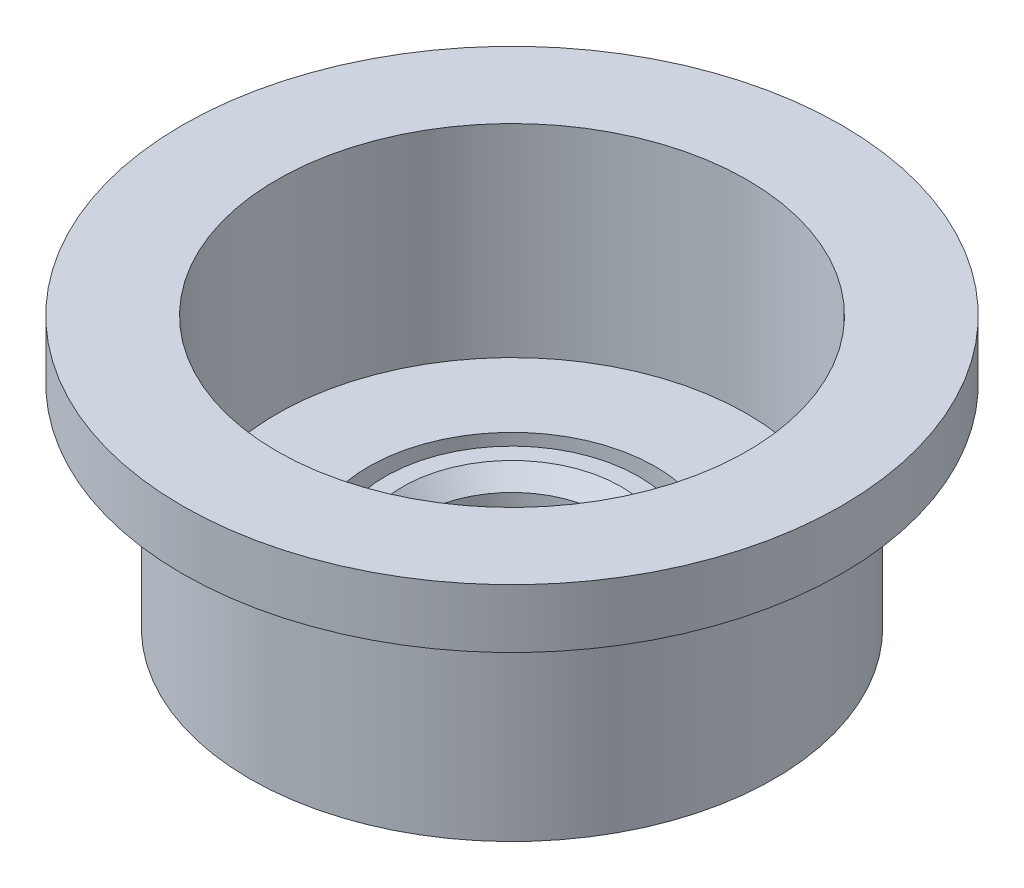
ISO-10303-21;
HEADER;
FILE_DESCRIPTION(('STEP AP214'),'2;1');
FILE_NAME('part.step','',(''),(''),'','','');
FILE_SCHEMA(('AUTOMOTIVE_DESIGN { 1 0 10303 214 1 1 1 1 }'));
ENDSEC;
DATA;
#1=APPLICATION_CONTEXT('core data for automotive mechanical design processes');
#2=APPLICATION_PROTOCOL_DEFINITION('international standard','automotive_design',2000,#1);
#3=PRODUCT_CONTEXT('',#1,'mechanical');
#4=PRODUCT('Part','Part','',(#3));
#5=PRODUCT_RELATED_PRODUCT_CATEGORY('part','',(#4));
#6=PRODUCT_DEFINITION_FORMATION('','',#4);
#7=PRODUCT_DEFINITION_CONTEXT('part definition',#1,'design');
#8=PRODUCT_DEFINITION('design','',#6,#7);
#9=PRODUCT_DEFINITION_SHAPE('','',#8);
#10=(LENGTH_UNIT() NAMED_UNIT(*) SI_UNIT(.MILLI.,.METRE.));
#11=(NAMED_UNIT(*) PLANE_ANGLE_UNIT() SI_UNIT($,.RADIAN.));
#12=(NAMED_UNIT(*) SI_UNIT($,.STERADIAN.) SOLID_ANGLE_UNIT());
#13=UNCERTAINTY_MEASURE_WITH_UNIT(LENGTH_MEASURE(1.E-05),#10,'distance_accuracy_value','');
#14=(GEOMETRIC_REPRESENTATION_CONTEXT(3) GLOBAL_UNCERTAINTY_ASSIGNED_CONTEXT((#13)) GLOBAL_UNIT_ASSIGNED_CONTEXT((#10,
#11,#12)) REPRESENTATION_CONTEXT('',''));
#15=CARTESIAN_POINT('',(0.,0.,0.));
#16=DIRECTION('',(0.,0.,1.));
#17=DIRECTION('',(1.,0.,0.));
#18=AXIS2_PLACEMENT_3D('',#15,#16,#17);
#19=CARTESIAN_POINT('',(0.,6.34999999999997,11.90625));
#20=DIRECTION('',(0.,-1.,0.));
#21=DIRECTION('',(0.,0.,-1.));
#22=AXIS2_PLACEMENT_3D('',#19,#20,#21);
#23=PLANE('',#22);
#24=CARTESIAN_POINT('',(0.,6.34999999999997,0.));
#25=DIRECTION('',(0.,-1.,0.));
#26=DIRECTION('',(0.,0.,-1.));
#27=AXIS2_PLACEMENT_3D('',#24,#25,#26);
#28=CIRCLE('',#27,10.25525);
#29=CARTESIAN_POINT('',(0.,6.34999999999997,-10.25525));
#30=VERTEX_POINT('',#29);
#31=EDGE_CURVE('E43',#30,#30,#28,.T.);
#32=ORIENTED_EDGE('',*,*,#31,.T.);
#33=EDGE_LOOP('',(#32));
#34=FACE_BOUND('',#33,.T.);
#35=CARTESIAN_POINT('',(0.,6.34999999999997,0.));
#36=DIRECTION('',(0.,-1.,0.));
#37=DIRECTION('',(0.,0.,-1.));
#38=AXIS2_PLACEMENT_3D('',#35,#36,#37);
#39=CIRCLE('',#38,11.90625);
#40=CARTESIAN_POINT('',(0.,6.34999999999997,-11.90625));
#41=VERTEX_POINT('',#40);
#42=EDGE_CURVE('E47',#41,#41,#39,.T.);
#43=ORIENTED_EDGE('',*,*,#42,.F.);
#44=EDGE_LOOP('',(#43));
#45=FACE_BOUND('',#44,.T.);
#46=ADVANCED_FACE('F36',(#34,#45),#23,.F.);
#47=CARTESIAN_POINT('',(0.,0.,0.));
#48=DIRECTION('',(0.,-1.,0.));
#49=DIRECTION('',(0.,0.,-1.));
#50=AXIS2_PLACEMENT_3D('',#47,#48,#49);
#51=CYLINDRICAL_SURFACE('',#50,11.90625);
#52=CARTESIAN_POINT('',(0.,2.53999999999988,0.));
#53=DIRECTION('',(0.,-1.,0.));
#54=DIRECTION('',(0.,0.,-1.));
#55=AXIS2_PLACEMENT_3D('',#52,#53,#54);
#56=CIRCLE('',#55,11.90625);
#57=CARTESIAN_POINT('',(0.,2.53999999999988,-11.90625));
#58=VERTEX_POINT('',#57);
#59=EDGE_CURVE('E51',#58,#58,#56,.T.);
#60=ORIENTED_EDGE('',*,*,#59,.F.);
#61=EDGE_LOOP('',(#60));
#62=FACE_BOUND('',#61,.T.);
#63=ORIENTED_EDGE('',*,*,#42,.T.);
#64=EDGE_LOOP('',(#63));
#65=FACE_BOUND('',#64,.T.);
#66=ADVANCED_FACE('F137',(#62,#65),#51,.T.);
#67=CARTESIAN_POINT('',(1.11022302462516E-13,2.53999999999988,13.4937500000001));
#68=DIRECTION('',(0.,-1.,0.));
#69=DIRECTION('',(0.,0.,-1.));
#70=AXIS2_PLACEMENT_3D('',#67,#68,#69);
#71=PLANE('',#70);
#72=CARTESIAN_POINT('',(0.,2.53999999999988,0.));
#73=DIRECTION('',(0.,-1.,0.));
#74=DIRECTION('',(0.,0.,-1.));
#75=AXIS2_PLACEMENT_3D('',#72,#73,#74);
#76=CIRCLE('',#75,13.49375);
#77=CARTESIAN_POINT('',(0.,2.53999999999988,-13.49375));
#78=VERTEX_POINT('',#77);
#79=EDGE_CURVE('E56',#78,#78,#76,.T.);
#80=ORIENTED_EDGE('',*,*,#79,.F.);
#81=EDGE_LOOP('',(#80));
#82=FACE_BOUND('',#81,.T.);
#83=ORIENTED_EDGE('',*,*,#59,.T.);
#84=EDGE_LOOP('',(#83));
#85=FACE_BOUND('',#84,.T.);
#86=ADVANCED_FACE('F131',(#82,#85),#71,.F.);
#87=CARTESIAN_POINT('',(0.,0.,0.));
#88=DIRECTION('',(0.,-1.,0.));
#89=DIRECTION('',(0.,0.,-1.));
#90=AXIS2_PLACEMENT_3D('',#87,#88,#89);
#91=CYLINDRICAL_SURFACE('',#90,13.49375);
#92=CARTESIAN_POINT('',(0.,6.34999999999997,0.));
#93=DIRECTION('',(0.,-1.,0.));
#94=DIRECTION('',(0.,0.,-1.));
#95=AXIS2_PLACEMENT_3D('',#92,#93,#94);
#96=CIRCLE('',#95,13.49375);
#97=CARTESIAN_POINT('',(0.,6.34999999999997,-13.49375));
#98=VERTEX_POINT('',#97);
#99=EDGE_CURVE('E59',#98,#98,#96,.T.);
#100=ORIENTED_EDGE('',*,*,#99,.F.);
#101=EDGE_LOOP('',(#100));
#102=FACE_BOUND('',#101,.T.);
#103=ORIENTED_EDGE('',*,*,#79,.T.);
#104=EDGE_LOOP('',(#103));
#105=FACE_BOUND('',#104,.T.);
#106=ADVANCED_FACE('F125',(#102,#105),#91,.F.);
#107=CARTESIAN_POINT('',(0.,6.34999999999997,22.0979999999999));
#108=DIRECTION('',(0.,-1.,0.));
#109=DIRECTION('',(0.,0.,-1.));
#110=AXIS2_PLACEMENT_3D('',#107,#108,#109);
#111=PLANE('',#110);
#112=CARTESIAN_POINT('',(0.,6.34999999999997,0.));
#113=DIRECTION('',(0.,-1.,0.));
#114=DIRECTION('',(0.,0.,-1.));
#115=AXIS2_PLACEMENT_3D('',#112,#113,#114);
#116=CIRCLE('',#115,22.098);
#117=CARTESIAN_POINT('',(0.,6.34999999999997,-22.098));
#118=VERTEX_POINT('',#117);
#119=EDGE_CURVE('E62',#118,#118,#116,.T.);
#120=ORIENTED_EDGE('',*,*,#119,.F.);
#121=EDGE_LOOP('',(#120));
#122=FACE_BOUND('',#121,.T.);
#123=ORIENTED_EDGE('',*,*,#99,.T.);
#124=EDGE_LOOP('',(#123));
#125=FACE_BOUND('',#124,.T.);
#126=ADVANCED_FACE('F119',(#122,#125),#111,.F.);
#127=CARTESIAN_POINT('',(0.,0.,0.));
#128=DIRECTION('',(0.,-1.,0.));
#129=DIRECTION('',(0.,0.,-1.));
#130=AXIS2_PLACEMENT_3D('',#127,#128,#129);
#131=CYLINDRICAL_SURFACE('',#130,22.098);
#132=CARTESIAN_POINT('',(0.,25.3999999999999,0.));
#133=DIRECTION('',(0.,-1.,0.));
#134=DIRECTION('',(0.,0.,-1.));
#135=AXIS2_PLACEMENT_3D('',#132,#133,#134);
#136=CIRCLE('',#135,22.098);
#137=CARTESIAN_POINT('',(0.,25.3999999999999,-22.098));
#138=VERTEX_POINT('',#137);
#139=EDGE_CURVE('E65',#138,#138,#136,.T.);
#140=ORIENTED_EDGE('',*,*,#139,.F.);
#141=EDGE_LOOP('',(#140));
#142=FACE_BOUND('',#141,.T.);
#143=ORIENTED_EDGE('',*,*,#119,.T.);
#144=EDGE_LOOP('',(#143));
#145=FACE_BOUND('',#144,.T.);
#146=ADVANCED_FACE('F113',(#142,#145),#131,.F.);
#147=CARTESIAN_POINT('',(0.,25.3999999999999,30.988));
#148=DIRECTION('',(0.,-1.,0.));
#149=DIRECTION('',(0.,0.,-1.));
#150=AXIS2_PLACEMENT_3D('',#147,#148,#149);
#151=PLANE('',#150);
#152=CARTESIAN_POINT('',(0.,25.3999999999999,0.));
#153=DIRECTION('',(0.,-1.,0.));
#154=DIRECTION('',(0.,0.,-1.));
#155=AXIS2_PLACEMENT_3D('',#152,#153,#154);
#156=CIRCLE('',#155,30.988);
#157=CARTESIAN_POINT('',(0.,25.3999999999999,-30.988));
#158=VERTEX_POINT('',#157);
#159=EDGE_CURVE('E68',#158,#158,#156,.T.);
#160=ORIENTED_EDGE('',*,*,#159,.F.);
#161=EDGE_LOOP('',(#160));
#162=FACE_BOUND('',#161,.T.);
#163=ORIENTED_EDGE('',*,*,#139,.T.);
#164=EDGE_LOOP('',(#163));
#165=FACE_BOUND('',#164,.T.);
#166=ADVANCED_FACE('F107',(#162,#165),#151,.F.);
#167=CARTESIAN_POINT('',(0.,0.,0.));
#168=DIRECTION('',(0.,-1.,0.));
#169=DIRECTION('',(0.,0.,-1.));
#170=AXIS2_PLACEMENT_3D('',#167,#168,#169);
#171=CYLINDRICAL_SURFACE('',#170,30.988);
#172=CARTESIAN_POINT('',(0.,19.8752784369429,0.));
#173=DIRECTION('',(0.,-1.,0.));
#174=DIRECTION('',(0.,0.,-1.));
#175=AXIS2_PLACEMENT_3D('',#172,#173,#174);
#176=CIRCLE('',#175,30.988);
#177=CARTESIAN_POINT('',(0.,19.8752784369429,-30.988));
#178=VERTEX_POINT('',#177);
#179=EDGE_CURVE('E71',#178,#178,#176,.T.);
#180=ORIENTED_EDGE('',*,*,#179,.F.);
#181=EDGE_LOOP('',(#180));
#182=FACE_BOUND('',#181,.T.);
#183=ORIENTED_EDGE('',*,*,#159,.T.);
#184=EDGE_LOOP('',(#183));
#185=FACE_BOUND('',#184,.T.);
#186=ADVANCED_FACE('F101',(#182,#185),#171,.T.);
#187=CARTESIAN_POINT('',(0.,19.8752784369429,24.6379999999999));
#188=DIRECTION('',(0.,1.,0.));
#189=DIRECTION('',(0.,0.,1.));
#190=AXIS2_PLACEMENT_3D('',#187,#188,#189);
#191=PLANE('',#190);
#192=CARTESIAN_POINT('',(0.,19.8752784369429,0.));
#193=DIRECTION('',(0.,-1.,0.));
#194=DIRECTION('',(0.,0.,-1.));
#195=AXIS2_PLACEMENT_3D('',#192,#193,#194);
#196=CIRCLE('',#195,24.638);
#197=CARTESIAN_POINT('',(0.,19.8752784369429,-24.638));
#198=VERTEX_POINT('',#197);
#199=EDGE_CURVE('E74',#198,#198,#196,.T.);
#200=ORIENTED_EDGE('',*,*,#199,.F.);
#201=EDGE_LOOP('',(#200));
#202=FACE_BOUND('',#201,.T.);
#203=ORIENTED_EDGE('',*,*,#179,.T.);
#204=EDGE_LOOP('',(#203));
#205=FACE_BOUND('',#204,.T.);
#206=ADVANCED_FACE('F95',(#202,#205),#191,.F.);
#207=CARTESIAN_POINT('',(0.,0.,0.));
#208=DIRECTION('',(0.,-1.,0.));
#209=DIRECTION('',(0.,0.,-1.));
#210=AXIS2_PLACEMENT_3D('',#207,#208,#209);
#211=CYLINDRICAL_SURFACE('',#210,24.638);
#212=CARTESIAN_POINT('',(0.,0.,0.));
#213=DIRECTION('',(0.,-1.,0.));
#214=DIRECTION('',(0.,0.,-1.));
#215=AXIS2_PLACEMENT_3D('',#212,#213,#214);
#216=CIRCLE('',#215,24.638);
#217=CARTESIAN_POINT('',(0.,0.,-24.638));
#218=VERTEX_POINT('',#217);
#219=EDGE_CURVE('E77',#218,#218,#216,.T.);
#220=ORIENTED_EDGE('',*,*,#219,.F.);
#221=EDGE_LOOP('',(#220));
#222=FACE_BOUND('',#221,.T.);
#223=ORIENTED_EDGE('',*,*,#199,.T.);
#224=EDGE_LOOP('',(#223));
#225=FACE_BOUND('',#224,.T.);
#226=ADVANCED_FACE('F89',(#222,#225),#211,.T.);
#227=CARTESIAN_POINT('',(0.,-1.11022302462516E-13,24.6379999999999));
#228=DIRECTION('',(0.,1.,0.));
#229=DIRECTION('',(0.,0.,1.));
#230=AXIS2_PLACEMENT_3D('',#227,#228,#229);
#231=PLANE('',#230);
#232=CARTESIAN_POINT('',(0.,0.,0.));
#233=DIRECTION('',(0.,-1.,0.));
#234=DIRECTION('',(0.,0.,-1.));
#235=AXIS2_PLACEMENT_3D('',#232,#233,#234);
#236=CIRCLE('',#235,8.73124999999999);
#237=CARTESIAN_POINT('',(0.,0.,-8.73124999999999));
#238=VERTEX_POINT('',#237);
#239=EDGE_CURVE('E80',#238,#238,#236,.T.);
#240=ORIENTED_EDGE('',*,*,#239,.F.);
#241=EDGE_LOOP('',(#240));
#242=FACE_BOUND('',#241,.T.);
#243=ORIENTED_EDGE('',*,*,#219,.T.);
#244=EDGE_LOOP('',(#243));
#245=FACE_BOUND('',#244,.T.);
#246=ADVANCED_FACE('F86',(#242,#245),#231,.F.);
#247=CARTESIAN_POINT('',(0.,0.,0.));
#248=DIRECTION('',(0.,-1.,0.));
#249=DIRECTION('',(0.,0.,-1.));
#250=AXIS2_PLACEMENT_3D('',#247,#248,#249);
#251=CYLINDRICAL_SURFACE('',#250,8.73124999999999);
#252=CARTESIAN_POINT('',(0.,4.826,0.));
#253=DIRECTION('',(0.,-1.,0.));
#254=DIRECTION('',(0.,0.,-1.));
#255=AXIS2_PLACEMENT_3D('',#252,#253,#254);
#256=CIRCLE('',#255,8.73124999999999);
#257=CARTESIAN_POINT('',(0.,4.826,-8.73124999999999));
#258=VERTEX_POINT('',#257);
#259=EDGE_CURVE('E10',#258,#258,#256,.F.);
#260=ORIENTED_EDGE('',*,*,#259,.T.);
#261=EDGE_LOOP('',(#260));
#262=FACE_BOUND('',#261,.T.);
#263=ORIENTED_EDGE('',*,*,#239,.T.);
#264=EDGE_LOOP('',(#263));
#265=FACE_BOUND('',#264,.T.);
#266=ADVANCED_FACE('F84',(#262,#265),#251,.F.);
#267=CARTESIAN_POINT('',(0.,6.34999999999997,0.));
#268=DIRECTION('',(0.,1.,0.));
#269=DIRECTION('',(0.,0.,1.));
#270=AXIS2_PLACEMENT_3D('',#267,#268,#269);
#271=CONICAL_SURFACE('',#270,10.25525,0.785398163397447);
#272=ORIENTED_EDGE('',*,*,#259,.F.);
#273=EDGE_LOOP('',(#272));
#274=FACE_BOUND('',#273,.T.);
#275=ORIENTED_EDGE('',*,*,#31,.F.);
#276=EDGE_LOOP('',(#275));
#277=FACE_BOUND('',#276,.T.);
#278=ADVANCED_FACE('F38',(#274,#277),#271,.F.);
#279=CLOSED_SHELL('',(#46,#66,#86,#106,#126,#146,#166,#186,#206,#226,#246,#266,#278));
#280=MANIFOLD_SOLID_BREP('B2',#279);
#281=ADVANCED_BREP_SHAPE_REPRESENTATION('',(#18,#280),#14);
#282=SHAPE_DEFINITION_REPRESENTATION(#9,#281);
ENDSEC;
END-ISO-10303-21;
